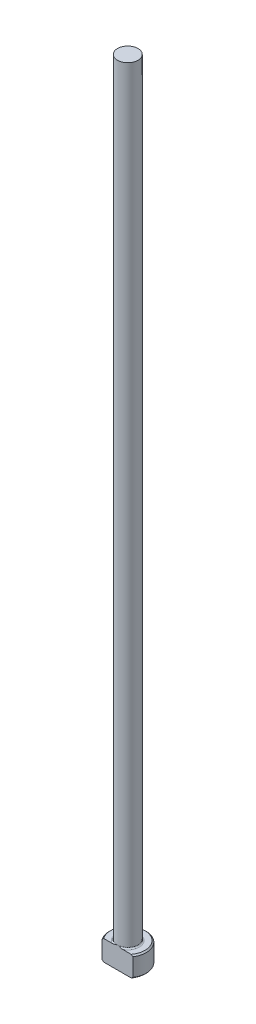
from build123d import *

# Parameters (mm, degrees)
CHAMFER1_SIZE = 0.254
FILLET1_R     = 0.254
KEY_DEPTH     = 153.483544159


with BuildPart() as part:
    # Sketch1 → Revolve1 (revolve)
    with BuildSketch(Plane.XY, mode=Mode.PRIVATE) as revolve1_sk:
        Polygon((0, 0), (-3.5687, 0), (-3.5687, 3.9624), (-1.98374, 3.9624), (-1.98374, 152.4), (0, 152.4), align=None)
    revolve(revolve1_sk.sketch.rotate(Axis((0, 259.958771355, 0), (0, -1, 0)), 270), axis=Axis((0, 259.958771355, 0), (0, -1, 0)))

    # Chamfer1
    chamfer1_edges = [part.edges().sort_by_distance(p)[0] for p in [
        (0, 3.9624, -3.5687),
        (0, 0, -3.5687),
    ]]
    chamfer(chamfer1_edges, length=CHAMFER1_SIZE)

    # Fillet1
    fillet1_edges = [part.edges().sort_by_distance(p)[0] for p in [
        (0, 3.9624, -1.98374),
    ]]
    fillet(fillet1_edges, radius=FILLET1_R)

    # Sketch2 → Key (cut, through all)
    with BuildSketch(Plane(origin=(0, 0, 0), x_dir=(1, 0, 0), z_dir=(0, 1, 0))):
        with BuildLine():
            Line((-2.966546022, -1.98374), (2.966546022, -1.98374))
            ThreePointArc((2.966546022, -1.98374), (0, -3.5687), (-2.966546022, -1.98374))
        make_face()
    extrude(amount=KEY_DEPTH, mode=Mode.SUBTRACT)


solid = part.part
